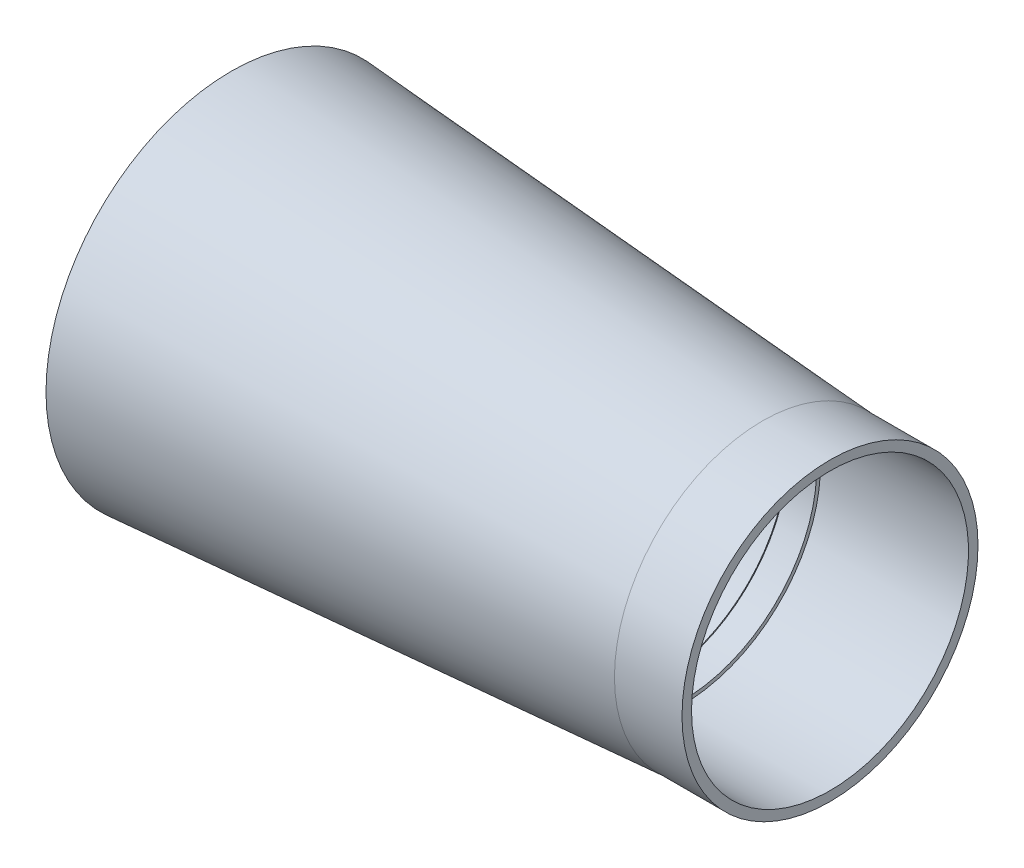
ISO-10303-21;
HEADER;
FILE_DESCRIPTION(('STEP AP214'),'2;1');
FILE_NAME('part.step','',(''),(''),'','','');
FILE_SCHEMA(('AUTOMOTIVE_DESIGN { 1 0 10303 214 1 1 1 1 }'));
ENDSEC;
DATA;
#1=APPLICATION_CONTEXT('core data for automotive mechanical design processes');
#2=APPLICATION_PROTOCOL_DEFINITION('international standard','automotive_design',2000,#1);
#3=PRODUCT_CONTEXT('',#1,'mechanical');
#4=PRODUCT('Part','Part','',(#3));
#5=PRODUCT_RELATED_PRODUCT_CATEGORY('part','',(#4));
#6=PRODUCT_DEFINITION_FORMATION('','',#4);
#7=PRODUCT_DEFINITION_CONTEXT('part definition',#1,'design');
#8=PRODUCT_DEFINITION('design','',#6,#7);
#9=PRODUCT_DEFINITION_SHAPE('','',#8);
#10=(LENGTH_UNIT() NAMED_UNIT(*) SI_UNIT(.MILLI.,.METRE.));
#11=(NAMED_UNIT(*) PLANE_ANGLE_UNIT() SI_UNIT($,.RADIAN.));
#12=(NAMED_UNIT(*) SI_UNIT($,.STERADIAN.) SOLID_ANGLE_UNIT());
#13=UNCERTAINTY_MEASURE_WITH_UNIT(LENGTH_MEASURE(1.E-05),#10,'distance_accuracy_value','');
#14=(GEOMETRIC_REPRESENTATION_CONTEXT(3) GLOBAL_UNCERTAINTY_ASSIGNED_CONTEXT((#13)) GLOBAL_UNIT_ASSIGNED_CONTEXT((#10,
#11,#12)) REPRESENTATION_CONTEXT('',''));
#15=CARTESIAN_POINT('',(0.,0.,0.));
#16=DIRECTION('',(0.,0.,1.));
#17=DIRECTION('',(1.,0.,0.));
#18=AXIS2_PLACEMENT_3D('',#15,#16,#17);
#19=CARTESIAN_POINT('',(0.,146.,0.));
#20=DIRECTION('',(1.,0.,0.));
#21=DIRECTION('',(0.,0.,-1.));
#22=AXIS2_PLACEMENT_3D('',#19,#20,#21);
#23=PLANE('',#22);
#24=CARTESIAN_POINT('',(0.,0.,0.));
#25=DIRECTION('',(-1.,0.,0.));
#26=DIRECTION('',(0.,0.,1.));
#27=AXIS2_PLACEMENT_3D('',#24,#25,#26);
#28=CIRCLE('',#27,146.);
#29=CARTESIAN_POINT('',(0.,0.,146.));
#30=VERTEX_POINT('',#29);
#31=EDGE_CURVE('E723',#30,#30,#28,.T.);
#32=ORIENTED_EDGE('',*,*,#31,.F.);
#33=EDGE_LOOP('',(#32));
#34=FACE_BOUND('',#33,.T.);
#35=CARTESIAN_POINT('',(0.,0.,0.));
#36=DIRECTION('',(-1.,0.,0.));
#37=DIRECTION('',(0.,0.,1.));
#38=AXIS2_PLACEMENT_3D('',#35,#36,#37);
#39=CIRCLE('',#38,148.);
#40=CARTESIAN_POINT('',(0.,0.,148.));
#41=VERTEX_POINT('',#40);
#42=EDGE_CURVE('E10',#41,#41,#39,.T.);
#43=ORIENTED_EDGE('',*,*,#42,.T.);
#44=EDGE_LOOP('',(#43));
#45=FACE_BOUND('',#44,.T.);
#46=ADVANCED_FACE('F668',(#34,#45),#23,.F.);
#47=CARTESIAN_POINT('',(-29.15,0.,0.));
#48=DIRECTION('',(-1.,0.,0.));
#49=DIRECTION('',(0.,0.,1.));
#50=AXIS2_PLACEMENT_3D('',#47,#48,#49);
#51=CYLINDRICAL_SURFACE('',#50,148.);
#52=ORIENTED_EDGE('',*,*,#42,.F.);
#53=EDGE_LOOP('',(#52));
#54=FACE_BOUND('',#53,.T.);
#55=CARTESIAN_POINT('',(2.,0.,0.));
#56=DIRECTION('',(-1.,0.,0.));
#57=DIRECTION('',(0.,0.,1.));
#58=AXIS2_PLACEMENT_3D('',#55,#56,#57);
#59=CIRCLE('',#58,148.);
#60=CARTESIAN_POINT('',(2.,0.,148.));
#61=VERTEX_POINT('',#60);
#62=EDGE_CURVE('E674',#61,#61,#59,.T.);
#63=ORIENTED_EDGE('',*,*,#62,.T.);
#64=EDGE_LOOP('',(#63));
#65=FACE_BOUND('',#64,.T.);
#66=ADVANCED_FACE('F730',(#54,#65),#51,.T.);
#67=CARTESIAN_POINT('',(2.,148.,0.));
#68=DIRECTION('',(1.,0.,0.));
#69=DIRECTION('',(0.,0.,-1.));
#70=AXIS2_PLACEMENT_3D('',#67,#68,#69);
#71=PLANE('',#70);
#72=ORIENTED_EDGE('',*,*,#62,.F.);
#73=EDGE_LOOP('',(#72));
#74=FACE_BOUND('',#73,.T.);
#75=CARTESIAN_POINT('',(2.,0.,0.));
#76=DIRECTION('',(-1.,0.,0.));
#77=DIRECTION('',(0.,0.,1.));
#78=AXIS2_PLACEMENT_3D('',#75,#76,#77);
#79=CIRCLE('',#78,150.);
#80=CARTESIAN_POINT('',(2.,0.,150.));
#81=VERTEX_POINT('',#80);
#82=EDGE_CURVE('E678',#81,#81,#79,.T.);
#83=ORIENTED_EDGE('',*,*,#82,.T.);
#84=EDGE_LOOP('',(#83));
#85=FACE_BOUND('',#84,.T.);
#86=ADVANCED_FACE('F734',(#74,#85),#71,.F.);
#87=CARTESIAN_POINT('',(16.5174471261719,0.,0.));
#88=DIRECTION('',(1.,0.,0.));
#89=DIRECTION('',(0.,0.,-1.));
#90=AXIS2_PLACEMENT_3D('',#87,#88,#89);
#91=CONICAL_SURFACE('',#90,175.144956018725,1.0471975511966);
#92=ORIENTED_EDGE('',*,*,#82,.F.);
#93=EDGE_LOOP('',(#92));
#94=FACE_BOUND('',#93,.T.);
#95=CARTESIAN_POINT('',(16.5174471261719,0.,0.));
#96=DIRECTION('',(-1.,0.,0.));
#97=DIRECTION('',(0.,0.,1.));
#98=AXIS2_PLACEMENT_3D('',#95,#96,#97);
#99=CIRCLE('',#98,175.144956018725);
#100=CARTESIAN_POINT('',(16.5174471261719,0.,175.144956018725));
#101=VERTEX_POINT('',#100);
#102=EDGE_CURVE('E682',#101,#101,#99,.T.);
#103=ORIENTED_EDGE('',*,*,#102,.T.);
#104=EDGE_LOOP('',(#103));
#105=FACE_BOUND('',#104,.T.);
#106=ADVANCED_FACE('F739',(#94,#105),#91,.T.);
#107=CARTESIAN_POINT('',(519.1,0.,0.));
#108=DIRECTION('',(-1.,0.,0.));
#109=DIRECTION('',(0.,0.,1.));
#110=AXIS2_PLACEMENT_3D('',#107,#108,#109);
#111=CONICAL_SURFACE('',#110,140.,0.0698150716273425);
#112=ORIENTED_EDGE('',*,*,#102,.F.);
#113=EDGE_LOOP('',(#112));
#114=FACE_BOUND('',#113,.T.);
#115=CARTESIAN_POINT('',(519.1,0.,0.));
#116=DIRECTION('',(-1.,0.,0.));
#117=DIRECTION('',(0.,0.,1.));
#118=AXIS2_PLACEMENT_3D('',#115,#116,#117);
#119=CIRCLE('',#118,140.);
#120=CARTESIAN_POINT('',(519.1,0.,140.));
#121=VERTEX_POINT('',#120);
#122=EDGE_CURVE('E687',#121,#121,#119,.T.);
#123=ORIENTED_EDGE('',*,*,#122,.T.);
#124=EDGE_LOOP('',(#123));
#125=FACE_BOUND('',#124,.T.);
#126=ADVANCED_FACE('F745',(#114,#125),#111,.T.);
#127=CARTESIAN_POINT('',(-29.15,0.,0.));
#128=DIRECTION('',(-1.,0.,0.));
#129=DIRECTION('',(0.,0.,1.));
#130=AXIS2_PLACEMENT_3D('',#127,#128,#129);
#131=CYLINDRICAL_SURFACE('',#130,140.);
#132=ORIENTED_EDGE('',*,*,#122,.F.);
#133=EDGE_LOOP('',(#132));
#134=FACE_BOUND('',#133,.T.);
#135=CARTESIAN_POINT('',(583.,0.,0.));
#136=DIRECTION('',(-1.,0.,0.));
#137=DIRECTION('',(0.,0.,1.));
#138=AXIS2_PLACEMENT_3D('',#135,#136,#137);
#139=CIRCLE('',#138,140.);
#140=CARTESIAN_POINT('',(583.,0.,140.));
#141=VERTEX_POINT('',#140);
#142=EDGE_CURVE('E690',#141,#141,#139,.T.);
#143=ORIENTED_EDGE('',*,*,#142,.T.);
#144=EDGE_LOOP('',(#143));
#145=FACE_BOUND('',#144,.T.);
#146=ADVANCED_FACE('F749',(#134,#145),#131,.T.);
#147=CARTESIAN_POINT('',(583.,131.,0.));
#148=DIRECTION('',(-1.,0.,0.));
#149=DIRECTION('',(0.,0.,1.));
#150=AXIS2_PLACEMENT_3D('',#147,#148,#149);
#151=PLANE('',#150);
#152=ORIENTED_EDGE('',*,*,#142,.F.);
#153=EDGE_LOOP('',(#152));
#154=FACE_BOUND('',#153,.T.);
#155=CARTESIAN_POINT('',(583.,0.,0.));
#156=DIRECTION('',(-1.,0.,0.));
#157=DIRECTION('',(0.,0.,1.));
#158=AXIS2_PLACEMENT_3D('',#155,#156,#157);
#159=CIRCLE('',#158,131.);
#160=CARTESIAN_POINT('',(583.,0.,131.));
#161=VERTEX_POINT('',#160);
#162=EDGE_CURVE('E693',#161,#161,#159,.T.);
#163=ORIENTED_EDGE('',*,*,#162,.T.);
#164=EDGE_LOOP('',(#163));
#165=FACE_BOUND('',#164,.T.);
#166=ADVANCED_FACE('F753',(#154,#165),#151,.F.);
#167=CARTESIAN_POINT('',(-29.15,0.,0.));
#168=DIRECTION('',(-1.,0.,0.));
#169=DIRECTION('',(0.,0.,1.));
#170=AXIS2_PLACEMENT_3D('',#167,#168,#169);
#171=CYLINDRICAL_SURFACE('',#170,131.);
#172=ORIENTED_EDGE('',*,*,#162,.F.);
#173=EDGE_LOOP('',(#172));
#174=FACE_BOUND('',#173,.T.);
#175=CARTESIAN_POINT('',(443.,0.,0.));
#176=DIRECTION('',(-1.,0.,0.));
#177=DIRECTION('',(0.,0.,1.));
#178=AXIS2_PLACEMENT_3D('',#175,#176,#177);
#179=CIRCLE('',#178,131.);
#180=CARTESIAN_POINT('',(443.,0.,131.));
#181=VERTEX_POINT('',#180);
#182=EDGE_CURVE('E696',#181,#181,#179,.T.);
#183=ORIENTED_EDGE('',*,*,#182,.T.);
#184=EDGE_LOOP('',(#183));
#185=FACE_BOUND('',#184,.T.);
#186=ADVANCED_FACE('F757',(#174,#185),#171,.F.);
#187=CARTESIAN_POINT('',(443.,131.,0.));
#188=DIRECTION('',(-1.,0.,0.));
#189=DIRECTION('',(0.,0.,1.));
#190=AXIS2_PLACEMENT_3D('',#187,#188,#189);
#191=PLANE('',#190);
#192=ORIENTED_EDGE('',*,*,#182,.F.);
#193=EDGE_LOOP('',(#192));
#194=FACE_BOUND('',#193,.T.);
#195=CARTESIAN_POINT('',(443.,0.,0.));
#196=DIRECTION('',(-1.,0.,0.));
#197=DIRECTION('',(0.,0.,1.));
#198=AXIS2_PLACEMENT_3D('',#195,#196,#197);
#199=CIRCLE('',#198,127.5);
#200=CARTESIAN_POINT('',(443.,0.,127.5));
#201=VERTEX_POINT('',#200);
#202=EDGE_CURVE('E699',#201,#201,#199,.T.);
#203=ORIENTED_EDGE('',*,*,#202,.T.);
#204=EDGE_LOOP('',(#203));
#205=FACE_BOUND('',#204,.T.);
#206=ADVANCED_FACE('F761',(#194,#205),#191,.F.);
#207=CARTESIAN_POINT('',(-29.15,0.,0.));
#208=DIRECTION('',(-1.,0.,0.));
#209=DIRECTION('',(0.,0.,1.));
#210=AXIS2_PLACEMENT_3D('',#207,#208,#209);
#211=CYLINDRICAL_SURFACE('',#210,127.5);
#212=ORIENTED_EDGE('',*,*,#202,.F.);
#213=EDGE_LOOP('',(#212));
#214=FACE_BOUND('',#213,.T.);
#215=CARTESIAN_POINT('',(416.,0.,0.));
#216=DIRECTION('',(-1.,0.,0.));
#217=DIRECTION('',(0.,0.,1.));
#218=AXIS2_PLACEMENT_3D('',#215,#216,#217);
#219=CIRCLE('',#218,127.5);
#220=CARTESIAN_POINT('',(416.,0.,127.5));
#221=VERTEX_POINT('',#220);
#222=EDGE_CURVE('E702',#221,#221,#219,.T.);
#223=ORIENTED_EDGE('',*,*,#222,.T.);
#224=EDGE_LOOP('',(#223));
#225=FACE_BOUND('',#224,.T.);
#226=ADVANCED_FACE('F765',(#214,#225),#211,.F.);
#227=CARTESIAN_POINT('',(416.,127.5,0.));
#228=DIRECTION('',(-1.,0.,0.));
#229=DIRECTION('',(0.,0.,1.));
#230=AXIS2_PLACEMENT_3D('',#227,#228,#229);
#231=PLANE('',#230);
#232=ORIENTED_EDGE('',*,*,#222,.F.);
#233=EDGE_LOOP('',(#232));
#234=FACE_BOUND('',#233,.T.);
#235=CARTESIAN_POINT('',(416.,0.,0.));
#236=DIRECTION('',(-1.,0.,0.));
#237=DIRECTION('',(0.,0.,1.));
#238=AXIS2_PLACEMENT_3D('',#235,#236,#237);
#239=CIRCLE('',#238,126.5);
#240=CARTESIAN_POINT('',(416.,0.,126.5));
#241=VERTEX_POINT('',#240);
#242=EDGE_CURVE('E705',#241,#241,#239,.T.);
#243=ORIENTED_EDGE('',*,*,#242,.T.);
#244=EDGE_LOOP('',(#243));
#245=FACE_BOUND('',#244,.T.);
#246=ADVANCED_FACE('F769',(#234,#245),#231,.F.);
#247=CARTESIAN_POINT('',(-29.15,0.,0.));
#248=DIRECTION('',(-1.,0.,0.));
#249=DIRECTION('',(0.,0.,1.));
#250=AXIS2_PLACEMENT_3D('',#247,#248,#249);
#251=CYLINDRICAL_SURFACE('',#250,126.5);
#252=ORIENTED_EDGE('',*,*,#242,.F.);
#253=EDGE_LOOP('',(#252));
#254=FACE_BOUND('',#253,.T.);
#255=CARTESIAN_POINT('',(379.,0.,0.));
#256=DIRECTION('',(-1.,0.,0.));
#257=DIRECTION('',(0.,0.,1.));
#258=AXIS2_PLACEMENT_3D('',#255,#256,#257);
#259=CIRCLE('',#258,126.5);
#260=CARTESIAN_POINT('',(379.,0.,126.5));
#261=VERTEX_POINT('',#260);
#262=EDGE_CURVE('E708',#261,#261,#259,.T.);
#263=ORIENTED_EDGE('',*,*,#262,.T.);
#264=EDGE_LOOP('',(#263));
#265=FACE_BOUND('',#264,.T.);
#266=ADVANCED_FACE('F773',(#254,#265),#251,.F.);
#267=CARTESIAN_POINT('',(379.,123.,0.));
#268=DIRECTION('',(-1.,0.,0.));
#269=DIRECTION('',(0.,0.,1.));
#270=AXIS2_PLACEMENT_3D('',#267,#268,#269);
#271=PLANE('',#270);
#272=ORIENTED_EDGE('',*,*,#262,.F.);
#273=EDGE_LOOP('',(#272));
#274=FACE_BOUND('',#273,.T.);
#275=CARTESIAN_POINT('',(379.,0.,0.));
#276=DIRECTION('',(-1.,0.,0.));
#277=DIRECTION('',(0.,0.,1.));
#278=AXIS2_PLACEMENT_3D('',#275,#276,#277);
#279=CIRCLE('',#278,123.);
#280=CARTESIAN_POINT('',(379.,0.,123.));
#281=VERTEX_POINT('',#280);
#282=EDGE_CURVE('E711',#281,#281,#279,.T.);
#283=ORIENTED_EDGE('',*,*,#282,.T.);
#284=EDGE_LOOP('',(#283));
#285=FACE_BOUND('',#284,.T.);
#286=ADVANCED_FACE('F777',(#274,#285),#271,.F.);
#287=CARTESIAN_POINT('',(-29.15,0.,0.));
#288=DIRECTION('',(-1.,0.,0.));
#289=DIRECTION('',(0.,0.,1.));
#290=AXIS2_PLACEMENT_3D('',#287,#288,#289);
#291=CYLINDRICAL_SURFACE('',#290,123.);
#292=ORIENTED_EDGE('',*,*,#282,.F.);
#293=EDGE_LOOP('',(#292));
#294=FACE_BOUND('',#293,.T.);
#295=CARTESIAN_POINT('',(346.,0.,0.));
#296=DIRECTION('',(-1.,0.,0.));
#297=DIRECTION('',(0.,0.,1.));
#298=AXIS2_PLACEMENT_3D('',#295,#296,#297);
#299=CIRCLE('',#298,123.);
#300=CARTESIAN_POINT('',(346.,0.,123.));
#301=VERTEX_POINT('',#300);
#302=EDGE_CURVE('E714',#301,#301,#299,.T.);
#303=ORIENTED_EDGE('',*,*,#302,.T.);
#304=EDGE_LOOP('',(#303));
#305=FACE_BOUND('',#304,.T.);
#306=ADVANCED_FACE('F781',(#294,#305),#291,.F.);
#307=CARTESIAN_POINT('',(346.,123.,0.));
#308=DIRECTION('',(-1.,0.,0.));
#309=DIRECTION('',(0.,0.,1.));
#310=AXIS2_PLACEMENT_3D('',#307,#308,#309);
#311=PLANE('',#310);
#312=ORIENTED_EDGE('',*,*,#302,.F.);
#313=EDGE_LOOP('',(#312));
#314=FACE_BOUND('',#313,.T.);
#315=CARTESIAN_POINT('',(346.,0.,0.));
#316=DIRECTION('',(-1.,0.,0.));
#317=DIRECTION('',(0.,0.,1.));
#318=AXIS2_PLACEMENT_3D('',#315,#316,#317);
#319=CIRCLE('',#318,120.);
#320=CARTESIAN_POINT('',(346.,0.,120.));
#321=VERTEX_POINT('',#320);
#322=EDGE_CURVE('E717',#321,#321,#319,.T.);
#323=ORIENTED_EDGE('',*,*,#322,.T.);
#324=EDGE_LOOP('',(#323));
#325=FACE_BOUND('',#324,.T.);
#326=ADVANCED_FACE('F785',(#314,#325),#311,.F.);
#327=CARTESIAN_POINT('',(-29.15,0.,0.));
#328=DIRECTION('',(-1.,0.,0.));
#329=DIRECTION('',(0.,0.,1.));
#330=AXIS2_PLACEMENT_3D('',#327,#328,#329);
#331=CYLINDRICAL_SURFACE('',#330,120.);
#332=ORIENTED_EDGE('',*,*,#322,.F.);
#333=EDGE_LOOP('',(#332));
#334=FACE_BOUND('',#333,.T.);
#335=CARTESIAN_POINT('',(326.,0.,0.));
#336=DIRECTION('',(-1.,0.,0.));
#337=DIRECTION('',(0.,0.,1.));
#338=AXIS2_PLACEMENT_3D('',#335,#336,#337);
#339=CIRCLE('',#338,120.);
#340=CARTESIAN_POINT('',(326.,0.,120.));
#341=VERTEX_POINT('',#340);
#342=EDGE_CURVE('E720',#341,#341,#339,.T.);
#343=ORIENTED_EDGE('',*,*,#342,.T.);
#344=EDGE_LOOP('',(#343));
#345=FACE_BOUND('',#344,.T.);
#346=ADVANCED_FACE('F789',(#334,#345),#331,.F.);
#347=CARTESIAN_POINT('',(0.,0.,0.));
#348=DIRECTION('',(-1.,0.,0.));
#349=DIRECTION('',(0.,0.,1.));
#350=AXIS2_PLACEMENT_3D('',#347,#348,#349);
#351=CONICAL_SURFACE('',#350,146.,0.0795861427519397);
#352=ORIENTED_EDGE('',*,*,#342,.F.);
#353=EDGE_LOOP('',(#352));
#354=FACE_BOUND('',#353,.T.);
#355=ORIENTED_EDGE('',*,*,#31,.T.);
#356=EDGE_LOOP('',(#355));
#357=FACE_BOUND('',#356,.T.);
#358=ADVANCED_FACE('F727',(#354,#357),#351,.F.);
#359=CLOSED_SHELL('',(#46,#66,#86,#106,#126,#146,#166,#186,#206,#226,#246,#266,#286,#306,#326,
#346,#358));
#360=MANIFOLD_SOLID_BREP('B2',#359);
#361=ADVANCED_BREP_SHAPE_REPRESENTATION('',(#18,#360),#14);
#362=SHAPE_DEFINITION_REPRESENTATION(#9,#361);
ENDSEC;
END-ISO-10303-21;
